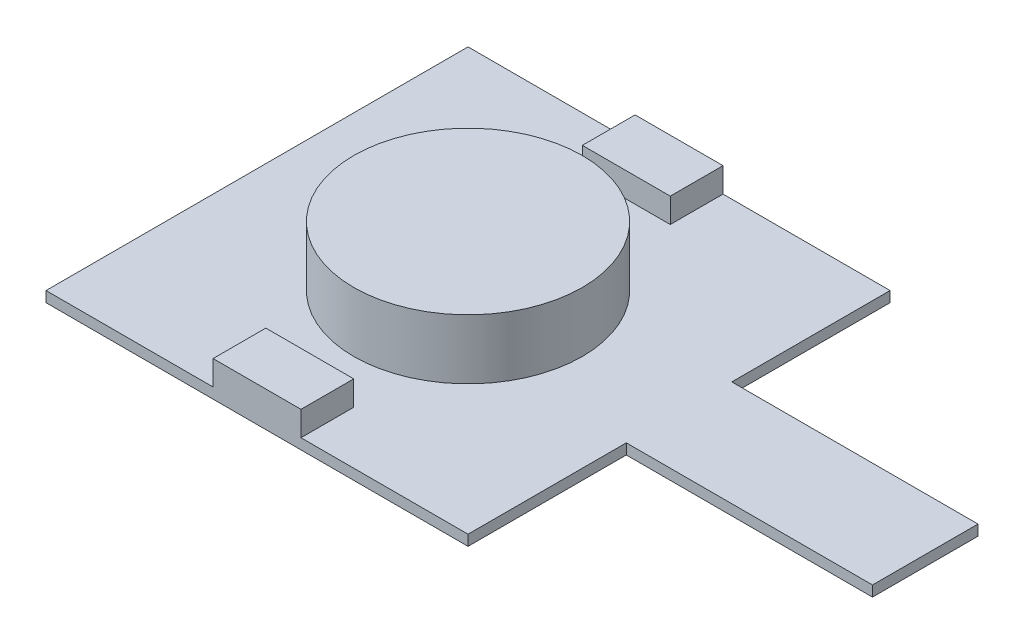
from build123d import *

# Parameters (mm, degrees)
SKETCH1_R           = 3.25
BOSS_EXTRUDE1_DEPTH = 0.3
SKETCH1_3_W         = 2.5
SKETCH1_3_H         = 1.5
BOSS_EXTRUDE2_DEPTH = 1
SKETCH1_4_R         = 3.25
BOSS_EXTRUDE3_DEPTH = 2


with BuildPart() as part:
    # Sketch1 → Boss-Extrude1 (new body)
    with BuildSketch(Plane(origin=(0, 0, 0), x_dir=(1, 0, 0), z_dir=(0, 1, 0))):
        Polygon((0, 12), (0, 0), (4.75, 0), (4.75, 1.5), (7.25, 1.5), (7.25, 0), (12, 0), (12, 4.5), (19, 4.5), (19, 7.5), (12, 7.5), (12, 12), (7.25, 12), (7.25, 10.5), (4.75, 10.5), (4.75, 12), align=None)
        with Locations(Location((6, 6, 0), (0, 0, 270))):
            Circle(SKETCH1_R, mode=Mode.SUBTRACT)
    extrude(amount=BOSS_EXTRUDE1_DEPTH)

    # Sketch1_3 → Boss-Extrude2 (add)
    with BuildSketch(Plane(origin=(0, 0, 0), x_dir=(1, 0, 0), z_dir=(0, 1, 0))):
        with Locations((6, 0.75)):
            Rectangle(SKETCH1_3_W, SKETCH1_3_H)
        with Locations((6, 11.25)):
            Rectangle(SKETCH1_3_W, SKETCH1_3_H)
    extrude(amount=BOSS_EXTRUDE2_DEPTH)

    # Sketch1_4 → Boss-Extrude3 (add)
    with BuildSketch(Plane(origin=(0, 0, 0), x_dir=(1, 0, 0), z_dir=(0, 1, 0))):
        with Locations(Location((6, 6, 0), (0, 0, 270))):
            Circle(SKETCH1_4_R)
    extrude(amount=BOSS_EXTRUDE3_DEPTH)


solid = part.part
